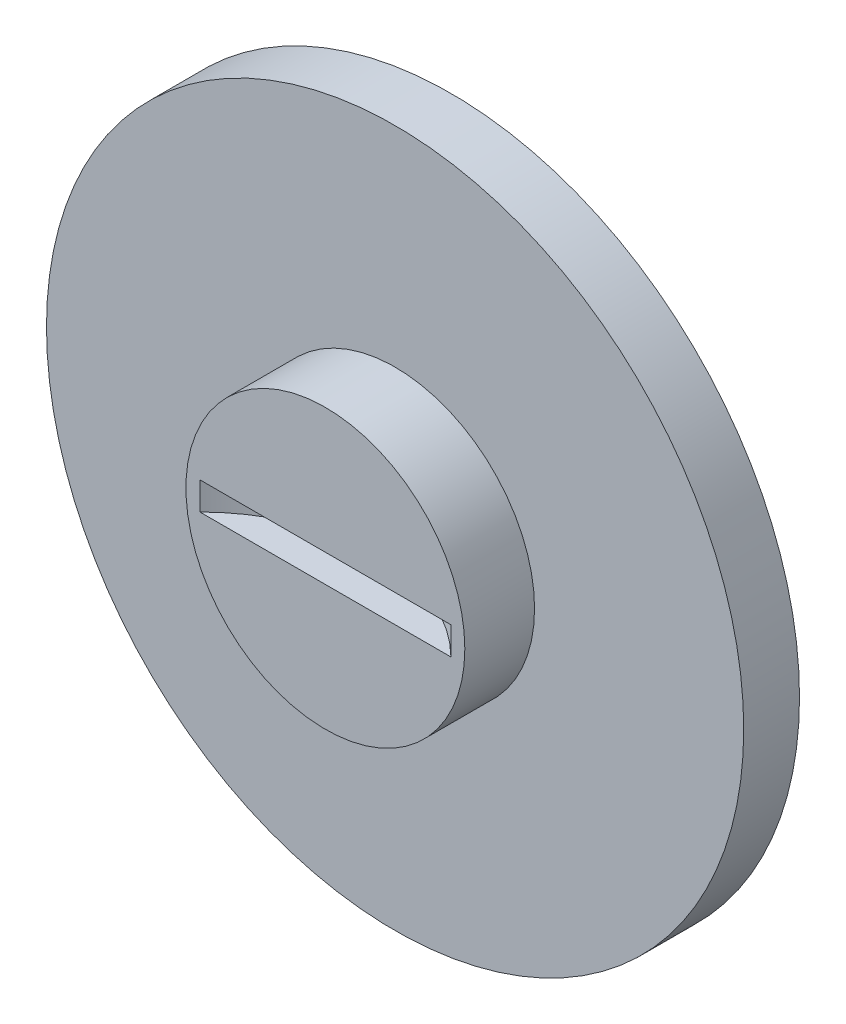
from build123d import *

# Parameters (mm, degrees)
SKETCH1_R           = 25
BOSS_EXTRUDE1_DEPTH = 4
SKETCH3_R           = 10
BOSS_EXTRUDE2_DEPTH = 5
CUT_EXTRUDE1_DEPTH  = 1


with BuildPart() as part:
    # Sketch1 → Boss-Extrude1 (new body)
    with BuildSketch(Plane.XY):
        Circle(SKETCH1_R)
    extrude(amount=-BOSS_EXTRUDE1_DEPTH)

    # Sketch3 → Boss-Extrude2 (add)
    with BuildSketch(Plane.XY):
        Circle(SKETCH3_R)
    extrude(amount=BOSS_EXTRUDE2_DEPTH)

    # Sketch4 → Cut-Extrude1 (cut, symmetric)
    with BuildSketch(Plane(origin=(0, 0, 0), x_dir=(1, 0, 0), z_dir=(0, 1, 0))):
        with BuildLine():
            Line((-9, -5), (-9, -8.345356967))
            Line((-9, -8.345356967), (9, -8.345356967))
            Line((9, -8.345356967), (9, -5))
            ThreePointArc((9, -5), (0, -1.272077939), (-9, -5))
        make_face()
    extrude(amount=CUT_EXTRUDE1_DEPTH, both=True, mode=Mode.SUBTRACT)


solid = part.part
